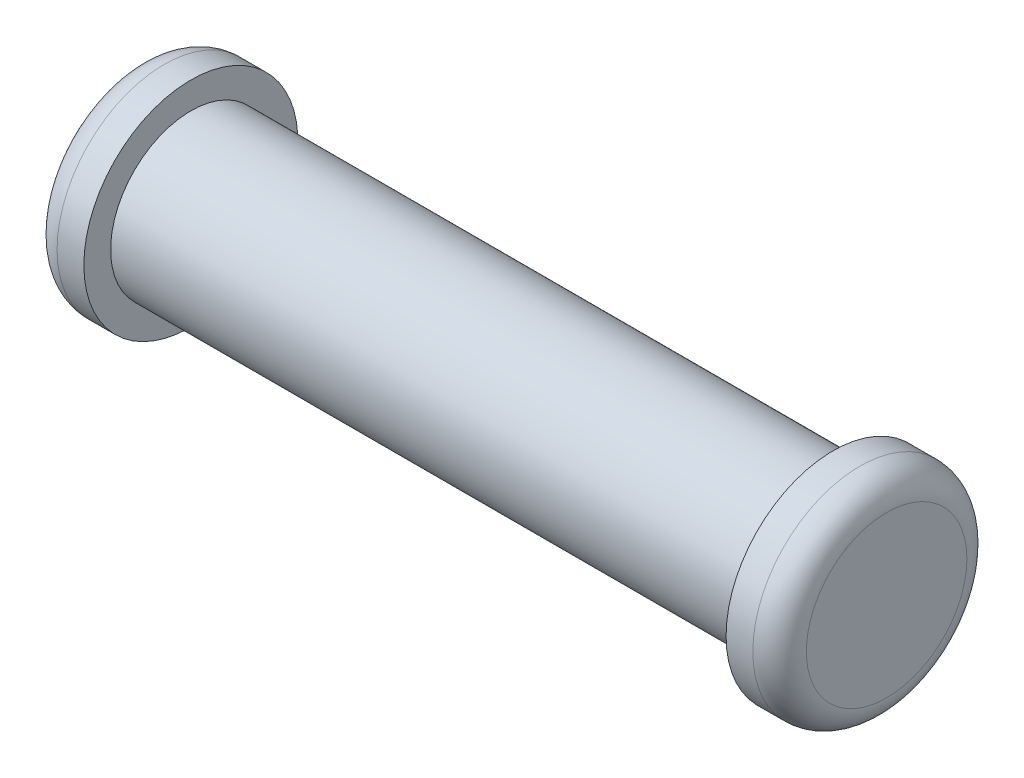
ISO-10303-21;
HEADER;
FILE_DESCRIPTION(('STEP AP214'),'2;1');
FILE_NAME('part.step','',(''),(''),'','','');
FILE_SCHEMA(('AUTOMOTIVE_DESIGN { 1 0 10303 214 1 1 1 1 }'));
ENDSEC;
DATA;
#1=APPLICATION_CONTEXT('core data for automotive mechanical design processes');
#2=APPLICATION_PROTOCOL_DEFINITION('international standard','automotive_design',2000,#1);
#3=PRODUCT_CONTEXT('',#1,'mechanical');
#4=PRODUCT('Part','Part','',(#3));
#5=PRODUCT_RELATED_PRODUCT_CATEGORY('part','',(#4));
#6=PRODUCT_DEFINITION_FORMATION('','',#4);
#7=PRODUCT_DEFINITION_CONTEXT('part definition',#1,'design');
#8=PRODUCT_DEFINITION('design','',#6,#7);
#9=PRODUCT_DEFINITION_SHAPE('','',#8);
#10=(LENGTH_UNIT() NAMED_UNIT(*) SI_UNIT(.MILLI.,.METRE.));
#11=(NAMED_UNIT(*) PLANE_ANGLE_UNIT() SI_UNIT($,.RADIAN.));
#12=(NAMED_UNIT(*) SI_UNIT($,.STERADIAN.) SOLID_ANGLE_UNIT());
#13=UNCERTAINTY_MEASURE_WITH_UNIT(LENGTH_MEASURE(1.E-05),#10,'distance_accuracy_value','');
#14=(GEOMETRIC_REPRESENTATION_CONTEXT(3) GLOBAL_UNCERTAINTY_ASSIGNED_CONTEXT((#13)) GLOBAL_UNIT_ASSIGNED_CONTEXT((#10,
#11,#12)) REPRESENTATION_CONTEXT('',''));
#15=CARTESIAN_POINT('',(0.,0.,0.));
#16=DIRECTION('',(0.,0.,1.));
#17=DIRECTION('',(1.,0.,0.));
#18=AXIS2_PLACEMENT_3D('',#15,#16,#17);
#19=CARTESIAN_POINT('',(12.,0.,0.));
#20=DIRECTION('',(-1.,0.,0.));
#21=DIRECTION('',(0.,0.,1.));
#22=AXIS2_PLACEMENT_3D('',#19,#20,#21);
#23=CYLINDRICAL_SURFACE('',#22,1.5);
#24=CARTESIAN_POINT('',(12.,0.,0.));
#25=DIRECTION('',(1.,0.,0.));
#26=DIRECTION('',(0.,0.,-1.));
#27=AXIS2_PLACEMENT_3D('',#24,#25,#26);
#28=CIRCLE('',#27,1.5);
#29=CARTESIAN_POINT('',(12.,0.,-1.5));
#30=VERTEX_POINT('',#29);
#31=EDGE_CURVE('E63',#30,#30,#28,.T.);
#32=ORIENTED_EDGE('',*,*,#31,.F.);
#33=EDGE_LOOP('',(#32));
#34=FACE_BOUND('',#33,.T.);
#35=CARTESIAN_POINT('',(0.,0.,0.));
#36=DIRECTION('',(1.,0.,0.));
#37=DIRECTION('',(0.,0.,-1.));
#38=AXIS2_PLACEMENT_3D('',#35,#36,#37);
#39=CIRCLE('',#38,1.5);
#40=CARTESIAN_POINT('',(0.,0.,-1.5));
#41=VERTEX_POINT('',#40);
#42=EDGE_CURVE('E64',#41,#41,#39,.T.);
#43=ORIENTED_EDGE('',*,*,#42,.T.);
#44=EDGE_LOOP('',(#43));
#45=FACE_BOUND('',#44,.T.);
#46=ADVANCED_FACE('F43',(#34,#45),#23,.T.);
#47=CARTESIAN_POINT('',(-1.,0.,0.));
#48=DIRECTION('',(1.,0.,0.));
#49=DIRECTION('',(0.,0.,-1.));
#50=AXIS2_PLACEMENT_3D('',#47,#48,#49);
#51=CYLINDRICAL_SURFACE('',#50,2.);
#52=CARTESIAN_POINT('',(-0.5,0.,0.));
#53=DIRECTION('',(-1.,0.,0.));
#54=DIRECTION('',(0.,0.,1.));
#55=AXIS2_PLACEMENT_3D('',#52,#53,#54);
#56=CIRCLE('',#55,2.);
#57=CARTESIAN_POINT('',(-0.5,0.,2.));
#58=VERTEX_POINT('',#57);
#59=EDGE_CURVE('E54',#58,#58,#56,.F.);
#60=ORIENTED_EDGE('',*,*,#59,.T.);
#61=EDGE_LOOP('',(#60));
#62=FACE_BOUND('',#61,.T.);
#63=CARTESIAN_POINT('',(0.,0.,0.));
#64=DIRECTION('',(-1.,0.,0.));
#65=DIRECTION('',(0.,0.,1.));
#66=AXIS2_PLACEMENT_3D('',#63,#64,#65);
#67=CIRCLE('',#66,2.);
#68=CARTESIAN_POINT('',(0.,0.,2.));
#69=VERTEX_POINT('',#68);
#70=EDGE_CURVE('E67',#69,#69,#67,.T.);
#71=ORIENTED_EDGE('',*,*,#70,.T.);
#72=EDGE_LOOP('',(#71));
#73=FACE_BOUND('',#72,.T.);
#74=ADVANCED_FACE('F93',(#62,#73),#51,.T.);
#75=CARTESIAN_POINT('',(-1.,0.,0.));
#76=DIRECTION('',(-1.,0.,0.));
#77=DIRECTION('',(0.,0.,1.));
#78=AXIS2_PLACEMENT_3D('',#75,#76,#77);
#79=PLANE('',#78);
#80=CARTESIAN_POINT('',(-1.,0.,0.));
#81=DIRECTION('',(-1.,0.,0.));
#82=DIRECTION('',(0.,0.,1.));
#83=AXIS2_PLACEMENT_3D('',#80,#81,#82);
#84=CIRCLE('',#83,1.5);
#85=CARTESIAN_POINT('',(-1.,0.,1.5));
#86=VERTEX_POINT('',#85);
#87=EDGE_CURVE('E58',#86,#86,#84,.T.);
#88=ORIENTED_EDGE('',*,*,#87,.T.);
#89=EDGE_LOOP('',(#88));
#90=FACE_BOUND('',#89,.T.);
#91=ADVANCED_FACE('F100',(#90),#79,.T.);
#92=CARTESIAN_POINT('',(0.,0.,0.));
#93=DIRECTION('',(-1.,0.,0.));
#94=DIRECTION('',(0.,0.,1.));
#95=AXIS2_PLACEMENT_3D('',#92,#93,#94);
#96=PLANE('',#95);
#97=ORIENTED_EDGE('',*,*,#42,.F.);
#98=EDGE_LOOP('',(#97));
#99=FACE_BOUND('',#98,.T.);
#100=ORIENTED_EDGE('',*,*,#70,.F.);
#101=EDGE_LOOP('',(#100));
#102=FACE_BOUND('',#101,.T.);
#103=ADVANCED_FACE('F88',(#99,#102),#96,.F.);
#104=CARTESIAN_POINT('',(-0.5,0.,0.));
#105=DIRECTION('',(-1.,0.,0.));
#106=DIRECTION('',(0.,0.,1.));
#107=AXIS2_PLACEMENT_3D('',#104,#105,#106);
#108=TOROIDAL_SURFACE('',#107,1.5,0.5);
#109=ORIENTED_EDGE('',*,*,#59,.F.);
#110=EDGE_LOOP('',(#109));
#111=FACE_BOUND('',#110,.T.);
#112=ORIENTED_EDGE('',*,*,#87,.F.);
#113=EDGE_LOOP('',(#112));
#114=FACE_BOUND('',#113,.T.);
#115=ADVANCED_FACE('F81',(#111,#114),#108,.T.);
#116=CARTESIAN_POINT('',(13.,0.,0.));
#117=DIRECTION('',(-1.,0.,0.));
#118=DIRECTION('',(0.,0.,1.));
#119=AXIS2_PLACEMENT_3D('',#116,#117,#118);
#120=CYLINDRICAL_SURFACE('',#119,2.);
#121=CARTESIAN_POINT('',(12.5,0.,0.));
#122=DIRECTION('',(1.,0.,0.));
#123=DIRECTION('',(0.,0.,-1.));
#124=AXIS2_PLACEMENT_3D('',#121,#122,#123);
#125=CIRCLE('',#124,2.);
#126=CARTESIAN_POINT('',(12.5,0.,-2.));
#127=VERTEX_POINT('',#126);
#128=EDGE_CURVE('E50',#127,#127,#125,.F.);
#129=ORIENTED_EDGE('',*,*,#128,.T.);
#130=EDGE_LOOP('',(#129));
#131=FACE_BOUND('',#130,.T.);
#132=CARTESIAN_POINT('',(12.,0.,0.));
#133=DIRECTION('',(-1.,0.,0.));
#134=DIRECTION('',(0.,0.,1.));
#135=AXIS2_PLACEMENT_3D('',#132,#133,#134);
#136=CIRCLE('',#135,2.);
#137=CARTESIAN_POINT('',(12.,0.,2.));
#138=VERTEX_POINT('',#137);
#139=EDGE_CURVE('E72',#138,#138,#136,.T.);
#140=ORIENTED_EDGE('',*,*,#139,.F.);
#141=EDGE_LOOP('',(#140));
#142=FACE_BOUND('',#141,.T.);
#143=ADVANCED_FACE('F78',(#131,#142),#120,.T.);
#144=CARTESIAN_POINT('',(13.,0.,0.));
#145=DIRECTION('',(1.,0.,0.));
#146=DIRECTION('',(0.,0.,1.));
#147=AXIS2_PLACEMENT_3D('',#144,#145,#146);
#148=PLANE('',#147);
#149=CARTESIAN_POINT('',(13.,0.,0.));
#150=DIRECTION('',(1.,0.,0.));
#151=DIRECTION('',(0.,0.,-1.));
#152=AXIS2_PLACEMENT_3D('',#149,#150,#151);
#153=CIRCLE('',#152,1.5);
#154=CARTESIAN_POINT('',(13.,0.,-1.5));
#155=VERTEX_POINT('',#154);
#156=EDGE_CURVE('E10',#155,#155,#153,.T.);
#157=ORIENTED_EDGE('',*,*,#156,.T.);
#158=EDGE_LOOP('',(#157));
#159=FACE_BOUND('',#158,.T.);
#160=ADVANCED_FACE('F80',(#159),#148,.T.);
#161=CARTESIAN_POINT('',(12.,0.,0.));
#162=DIRECTION('',(1.,0.,0.));
#163=DIRECTION('',(0.,0.,1.));
#164=AXIS2_PLACEMENT_3D('',#161,#162,#163);
#165=PLANE('',#164);
#166=ORIENTED_EDGE('',*,*,#31,.T.);
#167=EDGE_LOOP('',(#166));
#168=FACE_BOUND('',#167,.T.);
#169=ORIENTED_EDGE('',*,*,#139,.T.);
#170=EDGE_LOOP('',(#169));
#171=FACE_BOUND('',#170,.T.);
#172=ADVANCED_FACE('F76',(#168,#171),#165,.F.);
#173=CARTESIAN_POINT('',(12.5,0.,0.));
#174=DIRECTION('',(1.,0.,0.));
#175=DIRECTION('',(0.,0.,-1.));
#176=AXIS2_PLACEMENT_3D('',#173,#174,#175);
#177=TOROIDAL_SURFACE('',#176,1.5,0.5);
#178=ORIENTED_EDGE('',*,*,#156,.F.);
#179=EDGE_LOOP('',(#178));
#180=FACE_BOUND('',#179,.T.);
#181=ORIENTED_EDGE('',*,*,#128,.F.);
#182=EDGE_LOOP('',(#181));
#183=FACE_BOUND('',#182,.T.);
#184=ADVANCED_FACE('F45',(#180,#183),#177,.T.);
#185=CLOSED_SHELL('',(#46,#74,#91,#103,#115,#143,#160,#172,#184));
#186=MANIFOLD_SOLID_BREP('B2',#185);
#187=ADVANCED_BREP_SHAPE_REPRESENTATION('',(#18,#186),#14);
#188=SHAPE_DEFINITION_REPRESENTATION(#9,#187);
ENDSEC;
END-ISO-10303-21;
